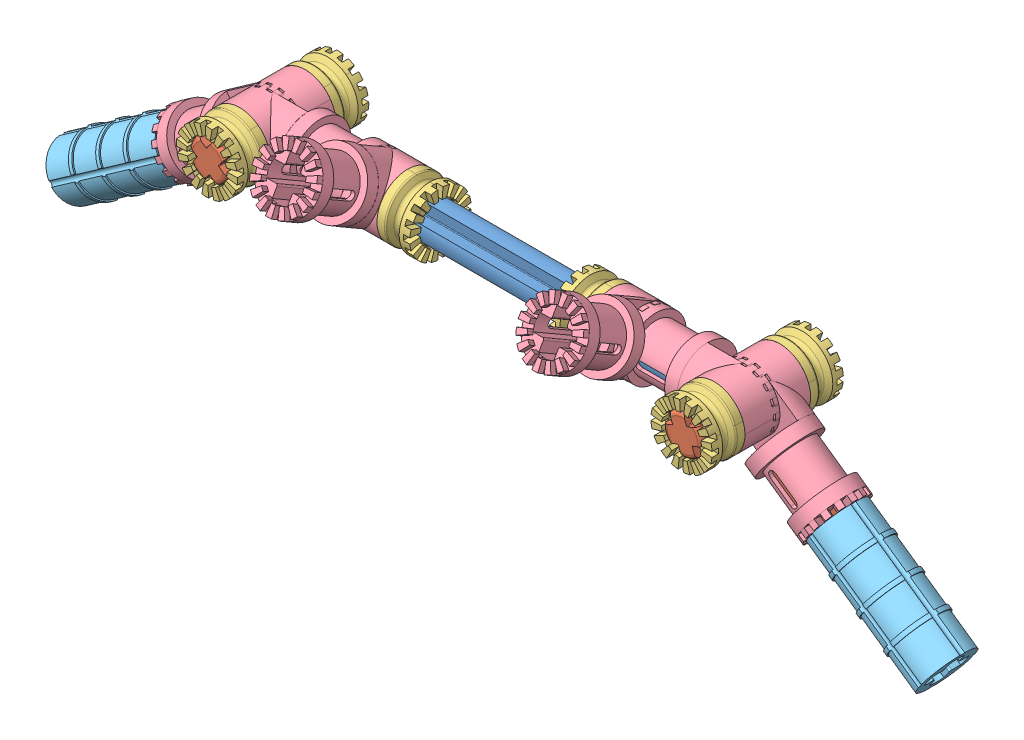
SolidWorks assembly Handlebar.SLDASM, configuration Default (file format 4400). Lengths in mm.
Overall size (109.97 30.23 21.24).
19 component instances, 5 part files, 51 mates.
Components (placement in the parent):
- Axle-48--1: Axle-48-.SLDPRT [Predeterminado] at origin size (48.08 4.7 4.7)
- Axle-16--1: Axle-16-.SLDPRT [Predeterminado] at (-28.5 0.0062 -0.312) x (0 0 -1) z (0.601844 0.798614 0) size (15.73 4.7 4.7)
- Axle-16--2: Axle-16-.SLDPRT [Predeterminado] at (28.5 -0.0062 -0.312) x (0 0 -1) z (0.933945 0.357416 0) size (15.73 4.7 4.7)
- small collar-1: small collar.sldprt [Default] at (-28.5 0.0062 -8.137) x (0.601844 0.798614 0) z (0.798614 -0.601844 0) size (7.37 3.94 7.37)
- small collar-4: small collar.sldprt [Default] at (-28.5 0.0062 7.62) x (-0.601844 -0.798614 0) z (0.798614 -0.601844 0) size (7.37 3.94 7.37)
- small collar-5: small collar.sldprt [Default] at (8.68 0 0) x (0 1 0) z (0 0 -1) size (7.37 3.94 7.37)
- small collar-6: small collar.sldprt [Default] at (-8.08 0 0) x (0 -1 0) z (0 0 -1) size (7.37 3.94 7.37)
- small collar-7: small collar.sldprt [Default] at (28.5 -0.0062 7.62) x (-0.933945 -0.357416 0) z (0.357416 -0.933945 0) size (7.37 3.94 7.37)
- small collar-8: small collar.sldprt [Default] at (28.5 -0.0062 -8.137) x (-0.933945 -0.357416 0) z (-0.357416 0.933945 0) size (7.37 3.94 7.37)
- HaakseBorgring Grijs-1: HaakseBorgring Grijs.sldprt [Default] at (16.817 0 0) x (0 0.5 0.866025) z (0 -0.866025 0.5) size (16.65 7.33 7.37)
- HaakseBorgring Grijs-2: HaakseBorgring Grijs.sldprt [Default] at (-16.217 0 0) x (0 0.5 0.866025) z (0 0.866025 -0.5) size (16.65 7.33 7.37)
- HaakseBorgring Grijs-3: HaakseBorgring Grijs.sldprt [Default] at (-28.5 0.0062 -0.517) x (1 0 0) z (0 -1 0) size (16.65 7.33 7.37)
- HaakseBorgring Grijs-4: HaakseBorgring Grijs.sldprt [Default] at (28.5 -0.0062 -0.517) x (-1 0 0) z (0 1 0) size (16.65 7.33 7.37)
- HaakseBorgring Grijs-5: HaakseBorgring Grijs.sldprt [Default] at (-28.5 0.0062 0) x (-0.819152 -0.573576 0) z (0.573576 -0.819152 0) size (16.65 7.33 7.37)
- HaakseBorgring Grijs-6: HaakseBorgring Grijs.sldprt [Default] at (28.5 -0.0062 0) x (0.819152 -0.573576 0) z (0.573576 0.819152 0) size (16.65 7.33 7.37)
- Voetsteun Grijs-1: Voetsteun Grijs.SLDPRT [기본 설정] at (-39.1143 -7.4336 -0.517) x (-0.40558 0.579228 0.707107) z (0.819152 0.573576 0) size (6.81 6.81 16)
- Voetsteun Grijs-2: Voetsteun Grijs.SLDPRT [기본 설정] at (52.2278 -16.613 -0.517) x (-0.40558 -0.579228 -0.707107) z (0.819152 -0.573576 0) size (6.81 6.81 16)
- Axle-16--3: Axle-16-.SLDPRT [Predeterminado] at (38.457 -6.9706 -0.517) x (0.819152 -0.573576 0) z (0 0 -1) size (15.73 4.7 4.7)
- Axle-16--4: Axle-16-.SLDPRT [Predeterminado] at (-38.45 -6.9684 -0.517) x (0.819152 0.573576 0) z (-0.573576 0.819152 0) size (15.73 4.7 4.7)
Mates (geometry in assembly coordinates):
- Concentric2: concentric anti-aligned: cylinder of Axle-48--1 through (24 0 0) axis (-1 0 0) radius 2.35; cylinder of HaakseBorgring Grijs-4 through (16.3 0 0) axis (1 0 0) radius 3.6502
- Coincident1: coincident anti-aligned: plane of Axle-48--1 through (24 2.1708 0.9) normal (0 0 1); plane of HaakseBorgring Grijs-4 through (24.174 2.2249 0.9) normal (0 0 -1)
- Coincident2: coincident aligned: plane of Axle-48--1 through (24 0 0) normal (1 0 0); plane of HaakseBorgring Grijs-4 through (24 0 0) normal (1 0 0)
- Concentric3: concentric aligned: cylinder of Axle-48--1 through (24 0 0) axis (-1 0 0) radius 2.35; cylinder of HaakseBorgring Grijs-3 through (-16.3 0 0) axis (-1 0 0) radius 3.6502
- Coincident3: coincident aligned: plane of HaakseBorgring Grijs-3 through (-28.5 0.0062 3.683) normal (0 0 1); plane of HaakseBorgring Grijs-4 through (28.5 -0.0062 3.683) normal (0 0 1)
- Coincident4: coincident aligned: plane of Axle-48--1 through (-24 0 0) normal (-1 0 0); plane of HaakseBorgring Grijs-3 through (-24 0 0) normal (-1 0 0)
- Concentric4: concentric anti-aligned: cylinder of Axle-48--1 through (24 0 0) axis (-1 0 0) radius 2.35; cylinder of HaakseBorgring Grijs-1 through (12.617 0 0) axis (1 0 0) radius 3.683
- Concentric5: concentric aligned: cylinder of Axle-48--1 through (24 0 0) axis (-1 0 0) radius 2.35; cylinder of HaakseBorgring Grijs-2 through (-11.9852 0 0) axis (-1 0 0) radius 3.683
- Coincident5: coincident anti-aligned: plane of HaakseBorgring Grijs-1 through (16.3 -5.0194 -1.3559) normal (1 0 0); plane of HaakseBorgring Grijs-4 through (16.3 0 0) normal (-1 0 0)
- Parallel1: parallel aligned: cylinder of HaakseBorgring Grijs-1 through (16.3 5.3447 9.2695) axis (0 -0.5 -0.866025) radius 2.85; cylinder of HaakseBorgring Grijs-2 through (-15.6682 5.3553 9.2634) axis (0 -0.5 -0.866025) radius 2.85
- Concentric7: concentric anti-aligned: cylinder of Axle-48--1 through (24 0 0) axis (-1 0 0) radius 2.35; cylinder of small collar-5 through (8.679 0 0) axis (1 0 0) radius 2.4
- Coincident7: coincident anti-aligned: plane of Axle-48--1 through (24 0.9 -2.1708) normal (0 1 0); plane of small collar-5 through (9.569 0.9 -0.9) normal (0 -1 0)
- Coincident8: coincident anti-aligned: plane of small collar-5 through (12.617 0 0) normal (1 0 0); plane of HaakseBorgring Grijs-1 through (12.617 0 0) normal (-1 0 0)
- Concentric8: concentric aligned: cylinder of Axle-48--1 through (24 0 0) axis (-1 0 0) radius 2.35; cylinder of small collar-6 through (-8.0472 0 0) axis (-1 0 0) radius 2.4
- Coincident9: coincident anti-aligned: plane of Axle-48--1 through (24 0.9 2.1708) normal (0 1 0); plane of small collar-6 through (-8.9372 0.9 2.2249) normal (0 -1 0)
- Coincident10: coincident anti-aligned: plane of small collar-6 through (-11.9852 0 0) normal (-1 0 0); plane of HaakseBorgring Grijs-2 through (-11.9852 0 0) normal (1 0 0)
- Angle1: planar angle = 2.617994 rad aligned: plane of HaakseBorgring Grijs-4 through (28.5 -0.0062 3.683) normal (0 0 1); plane of HaakseBorgring Grijs-1 through (16.3 2.2447 3.9002) normal (0 -0.5 -0.866025)
- Concentric9: concentric anti-aligned: cylinder of Axle-16--2 through (28.5 -0.0062 -8.137) axis (0 0 1) radius 2.35; cylinder of HaakseBorgring Grijs-4 through (28.5 -0.0062 3.683) axis (0 0 -1) radius 3.683
- Concentric10: concentric anti-aligned: cylinder of Axle-16--1 through (-28.5 0.0062 -8.137) axis (0 0 1) radius 2.35; cylinder of HaakseBorgring Grijs-3 through (-28.5 0.0062 3.683) axis (0 0 -1) radius 3.683
- Concentric11: concentric anti-aligned: cylinder of Axle-16--2 through (28.5 -0.0062 -8.137) axis (0 0 1) radius 2.35; cylinder of small collar-8 through (28.5 -0.0062 -4.2) axis (0 0 -1) radius 3.683
- Coincident12: coincident anti-aligned: plane of Axle-16--2 through (28.5647 2.343 -8.137) normal (0.933945 0.357416 0); plane of small collar-8 through (29.0189 1.1561 -7.248) normal (-0.933945 -0.357416 0)
- Concentric12: concentric anti-aligned: cylinder of Axle-16--2 through (28.5 -0.0062 -8.137) axis (0 0 1) radius 2.35; cylinder of HaakseBorgring Grijs-6 through (28.5 -0.0062 3.1332) axis (0 0 -1) radius 2.4
- Coincident14: coincident anti-aligned: plane of small collar-8 through (28.5 -0.0062 -4.2) normal (0 0 1); plane of HaakseBorgring Grijs-6 through (28.5 -0.0062 -4.2) normal (0 0 -1)
- Coincident15: coincident anti-aligned: plane of HaakseBorgring Grijs-4 through (28.5 -0.0062 -0.517) normal (0 0 -1); plane of HaakseBorgring Grijs-6 through (27.5867 5.1124 -0.517) normal (0 0 1)
- Concentric13: concentric anti-aligned: cylinder of Axle-16--2 through (28.5 -0.0062 -8.137) axis (0 0 1) radius 2.35; cylinder of small collar-7 through (28.5 -0.0062 7.621) axis (0 0 -1) radius 2.4
- Coincident16: coincident anti-aligned: plane of Axle-16--2 through (28.5647 2.343 -8.137) normal (0.933945 0.357416 0); plane of small collar-7 through (28.5454 2.3934 6.731) normal (-0.933945 -0.357416 0)
- Coincident17: coincident anti-aligned: plane of small collar-7 through (28.5 -0.0062 3.683) normal (0 0 -1); plane of HaakseBorgring Grijs-4 through (28.5 -0.0062 3.683) normal (0 0 1)
- Concentric15: concentric anti-aligned: cylinder of Axle-16--1 through (-28.5 0.0062 -8.137) axis (0 0 1) radius 2.35; cylinder of small collar-1 through (-28.5 0.0062 -4.2) axis (0 0 -1) radius 3.683
- Coincident19: coincident anti-aligned: plane of Axle-16--1 through (-30.5253 -1.1858 -8.137) normal (-0.798614 0.601844 0); plane of small collar-1 through (-30.5578 -1.229 -7.248) normal (0.798614 -0.601844 0)
- Coincident20: coincident aligned: plane of Axle-16--1 through (-28.5 0.0062 -8.137) normal (0 0 -1); plane of small collar-1 through (-28.5 0.0062 -8.137) normal (0 0 -1)
- Concentric16: concentric aligned: cylinder of Axle-16--1 through (-28.5 0.0062 -8.137) axis (0 0 1) radius 2.35; cylinder of HaakseBorgring Grijs-5 through (-28.5 0.0062 -4.2) axis (0 0 1) radius 3.683
- Coincident21: coincident anti-aligned: plane of small collar-1 through (-28.5 0.0062 -4.2) normal (0 0 1); plane of HaakseBorgring Grijs-5 through (-28.5 0.0062 -4.2) normal (0 0 -1)
- Coincident22: coincident anti-aligned: plane of HaakseBorgring Grijs-3 through (-32.184 -3.6628 0) normal (0 0 -1); plane of HaakseBorgring Grijs-5 through (-28.5 0.0062 0) normal (0 0 1)
- Concentric17: concentric anti-aligned: cylinder of Axle-16--1 through (-28.5 0.0062 -8.137) axis (0 0 1) radius 2.35; circle of small collar-4
- Coincident23: coincident anti-aligned: plane of Axle-16--1 through (-26.2247 -0.5816 -8.137) normal (0.601844 0.798614 0); plane of small collar-4 through (-29.7351 2.0639 6.731) normal (-0.601844 -0.798614 0)
- Coincident24: coincident anti-aligned: plane of small collar-4 through (-28.5 0.0062 3.683) normal (0 0 -1); plane of HaakseBorgring Grijs-3 through (-28.5 0.0062 3.683) normal (0 0 1)
- Concentric18: concentric aligned: cylinder of HaakseBorgring Grijs-6 through (38.4972 -6.9987 -0.517) axis (-0.819152 0.573576 0) radius 3.6502; cylinder of Axle-16--3 through (44.8669 -11.4589 -0.517) axis (-0.819152 0.573576 0) radius 2.35
- Coincident25: coincident anti-aligned: plane of HaakseBorgring Grijs-6 through (31.531 -3.2196 0.583) normal (0.573576 0.819152 0); plane of Axle-16--3 through (44.3507 -12.1961 1.6538) normal (-0.573576 -0.819152 0)
- Coincident26: coincident anti-aligned: plane of HaakseBorgring Grijs-6 through (32.0472 -2.4824 -0.517) normal (0.819152 -0.573576 0); plane of Axle-16--3 through (32.0472 -2.4824 -0.517) normal (-0.819152 0.573576 0)
- Concentric19: concentric anti-aligned: cylinder of Voetsteun Grijs-2 through (39.1214 -7.4358 -0.517) axis (0.819152 -0.573576 0) radius 3.25; cylinder of Axle-16--3 through (44.8669 -11.4589 -0.517) axis (-0.819152 0.573576 0) radius 2.35
- Coincident27: coincident anti-aligned: plane of Voetsteun Grijs-2 through (39.6376 -6.6986 0.383) normal (-0.573576 -0.819152 0); plane of Axle-16--3 through (45.3831 -10.7216 1.6538) normal (0.573576 0.819152 0)
- Coincident28: coincident anti-aligned: plane of HaakseBorgring Grijs-6 through (39.9887 -6.1972 -2.399) normal (0.819152 -0.573576 0); plane of Voetsteun Grijs-2 through (39.1214 -7.4358 -0.517) normal (-0.819152 0.573576 0)
- Concentric20: concentric anti-aligned: cylinder of HaakseBorgring Grijs-5 through (-37.2614 -6.1362 -0.517) axis (0.819152 0.573576 0) radius 2.85; cylinder of Axle-16--4 through (-32.0401 -2.4802 -0.517) axis (-0.819152 -0.573576 0) radius 2.35
- Coincident29: coincident anti-aligned: plane of HaakseBorgring Grijs-5 through (-32.5563 -1.7429 0.583) normal (0.573576 -0.819152 0); plane of Axle-16--4 through (-32.5563 -1.7429 1.6538) normal (-0.573576 0.819152 0)
- Coincident30: coincident anti-aligned: plane of HaakseBorgring Grijs-5 through (-32.0401 -2.4802 -0.517) normal (-0.819152 -0.573576 0); plane of Axle-16--4 through (-32.0401 -2.4802 -0.517) normal (0.819152 0.573576 0)
- Concentric21: concentric anti-aligned: cylinder of Voetsteun Grijs-1 through (-52.2208 -16.6108 -0.517) axis (0.819152 0.573576 0) radius 3.25; cylinder of Axle-16--4 through (-32.0401 -2.4802 -0.517) axis (-0.819152 -0.573576 0) radius 2.35
- Coincident31: coincident anti-aligned: plane of Voetsteun Grijs-1 through (-51.7045 -17.348 -1.417) normal (-0.573576 0.819152 0); plane of Axle-16--4 through (-31.5239 -3.2174 -2.6878) normal (0.573576 -0.819152 0)
- Coincident32: coincident anti-aligned: plane of HaakseBorgring Grijs-5 through (-38.247 -8.6722 -2.399) normal (-0.819152 -0.573576 0); plane of Voetsteun Grijs-1 through (-39.1143 -7.4336 -0.517) normal (0.819152 0.573576 0)
- Angle2: planar angle = 2.530727 rad aligned: cylinder of HaakseBorgring Grijs-6 through (37.2685 -6.1384 -0.517) axis (-0.819152 0.573576 0) radius 2.85; cylinder of HaakseBorgring Grijs-4 through (17.8 0 0) axis (1 0 0) radius 2.85
- Angle3: planar angle = 2.530727 rad aligned: cylinder of HaakseBorgring Grijs-3 through (-17.8 0 0) axis (-1 0 0) radius 2.85; cylinder of HaakseBorgring Grijs-5 through (-37.2614 -6.1362 -0.517) axis (0.819152 0.573576 0) radius 2.85
- Distance1: distance = 32 mm aligned: plane of HaakseBorgring Grijs-2 through (-16.6 1.2157 4.2934) normal (1 0 0); plane of HaakseBorgring Grijs-1 through (15.4 0.2309 4.8619) normal (1 0 0)
